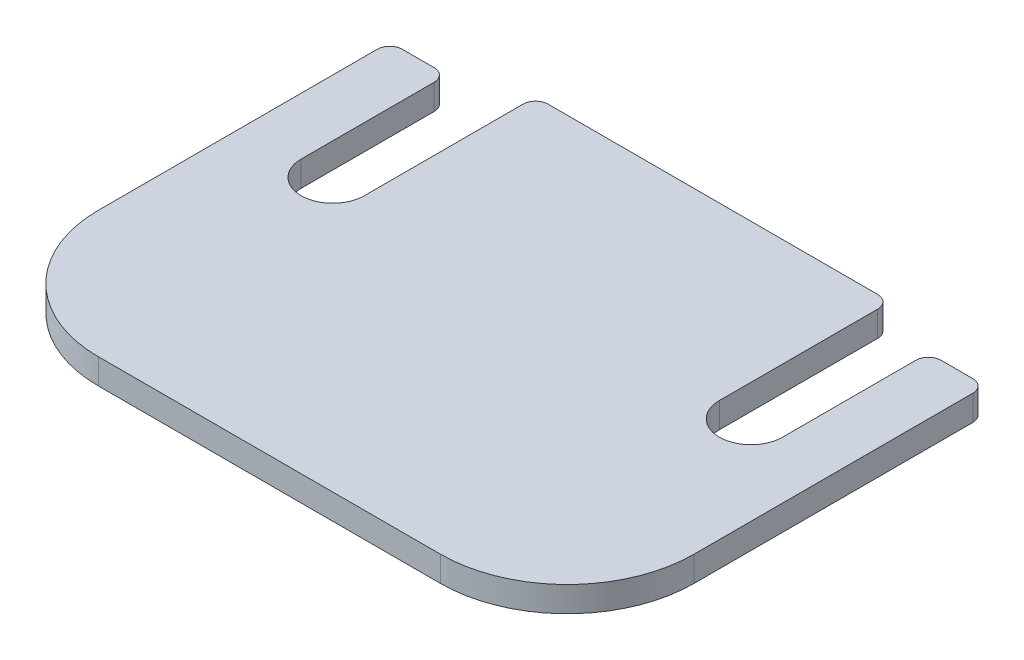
from build123d import *

# Parameters (mm, degrees)
RESSALTO_EXTRUS_O1_DEPTH = 2


with BuildPart() as part:
    # Esbo_o1 → Ressalto-extrus_o1 (new body)
    with BuildSketch(Plane(origin=(0, 0, 0), x_dir=(1, 0, 0), z_dir=(0, 1, 0))):
        with BuildLine():
            Line((-23.5, 14.5), (-23.5, -7.5))
            ThreePointArc((-23.5, -7.5), (-20.571067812, -14.571067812), (-13.5, -17.5))
            Line((-13.5, -17.5), (13.5, -17.5))
            ThreePointArc((13.5, -17.5), (20.571067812, -14.571067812), (23.5, -7.5))
            Line((23.5, -7.5), (23.5, 14.5))
            ThreePointArc((23.5, 14.5), (23.207106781, 15.207106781), (22.5, 15.5))
            Line((22.5, 15.5), (20, 15.5))
            ThreePointArc((20, 15.5), (19.292893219, 15.207106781), (19, 14.5))
            Line((19, 14.5), (19, 4))
            ThreePointArc((19, 4), (16.5, 1.5), (14, 4))
            Line((14, 4), (14, 16.5))
            ThreePointArc((14, 16.5), (13.707106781, 17.207106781), (13, 17.5))
            Line((13, 17.5), (-13, 17.5))
            ThreePointArc((-13, 17.5), (-13.707106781, 17.207106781), (-14, 16.5))
            Line((-14, 16.5), (-14, 4))
            ThreePointArc((-14, 4), (-16.5, 1.5), (-19, 4))
            Line((-19, 4), (-19, 14.5))
            ThreePointArc((-19, 14.5), (-19.292893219, 15.207106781), (-20, 15.5))
            Line((-20, 15.5), (-22.5, 15.5))
            ThreePointArc((-22.5, 15.5), (-23.207106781, 15.207106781), (-23.5, 14.5))
        make_face()
    extrude(amount=RESSALTO_EXTRUS_O1_DEPTH)


solid = part.part
